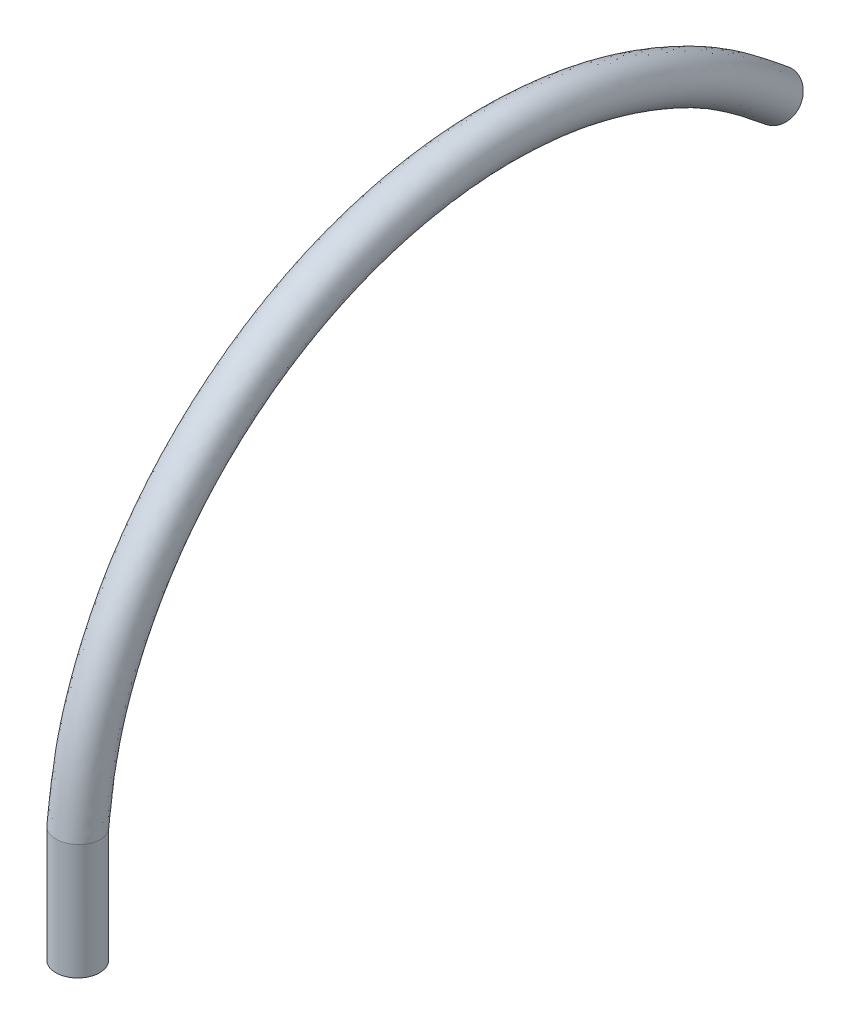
ISO-10303-21;
HEADER;
FILE_DESCRIPTION(('STEP AP214'),'2;1');
FILE_NAME('part.step','',(''),(''),'','','');
FILE_SCHEMA(('AUTOMOTIVE_DESIGN { 1 0 10303 214 1 1 1 1 }'));
ENDSEC;
DATA;
#1=APPLICATION_CONTEXT('core data for automotive mechanical design processes');
#2=APPLICATION_PROTOCOL_DEFINITION('international standard','automotive_design',2000,#1);
#3=PRODUCT_CONTEXT('',#1,'mechanical');
#4=PRODUCT('Part','Part','',(#3));
#5=PRODUCT_RELATED_PRODUCT_CATEGORY('part','',(#4));
#6=PRODUCT_DEFINITION_FORMATION('','',#4);
#7=PRODUCT_DEFINITION_CONTEXT('part definition',#1,'design');
#8=PRODUCT_DEFINITION('design','',#6,#7);
#9=PRODUCT_DEFINITION_SHAPE('','',#8);
#10=(LENGTH_UNIT() NAMED_UNIT(*) SI_UNIT(.MILLI.,.METRE.));
#11=(NAMED_UNIT(*) PLANE_ANGLE_UNIT() SI_UNIT($,.RADIAN.));
#12=(NAMED_UNIT(*) SI_UNIT($,.STERADIAN.) SOLID_ANGLE_UNIT());
#13=UNCERTAINTY_MEASURE_WITH_UNIT(LENGTH_MEASURE(1.E-05),#10,'distance_accuracy_value','');
#14=(GEOMETRIC_REPRESENTATION_CONTEXT(3) GLOBAL_UNCERTAINTY_ASSIGNED_CONTEXT((#13)) GLOBAL_UNIT_ASSIGNED_CONTEXT((#10,
#11,#12)) REPRESENTATION_CONTEXT('',''));
#15=CARTESIAN_POINT('',(0.,0.,0.));
#16=DIRECTION('',(0.,0.,1.));
#17=DIRECTION('',(1.,0.,0.));
#18=AXIS2_PLACEMENT_3D('',#15,#16,#17);
#19=CARTESIAN_POINT('',(0.,25.655313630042,0.));
#20=DIRECTION('',(0.,-1.,0.));
#21=DIRECTION('',(0.,0.,-1.));
#22=AXIS2_PLACEMENT_3D('',#19,#20,#21);
#23=CYLINDRICAL_SURFACE('',#22,3.175);
#24=CARTESIAN_POINT('',(0.,0.,0.));
#25=DIRECTION('',(0.,1.,0.));
#26=DIRECTION('',(0.,0.,1.));
#27=AXIS2_PLACEMENT_3D('',#24,#25,#26);
#28=CIRCLE('',#27,3.175);
#29=CARTESIAN_POINT('',(0.,0.,3.175));
#30=VERTEX_POINT('',#29);
#31=EDGE_CURVE('E43',#30,#30,#28,.T.);
#32=ORIENTED_EDGE('',*,*,#31,.T.);
#33=EDGE_LOOP('',(#32));
#34=FACE_BOUND('',#33,.T.);
#35=CARTESIAN_POINT('',(0.,16.6750575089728,0.));
#36=DIRECTION('',(0.,0.999319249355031,-0.0368922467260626));
#37=DIRECTION('',(0.,-0.0368922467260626,-0.999319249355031));
#38=AXIS2_PLACEMENT_3D('',#35,#36,#37);
#39=ELLIPSE('',#38,3.17716285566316,3.175);
#40=CARTESIAN_POINT('',(0.,16.5578448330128,-3.175));
#41=VERTEX_POINT('',#40);
#42=EDGE_CURVE('E11',#41,#41,#39,.T.);
#43=ORIENTED_EDGE('',*,*,#42,.F.);
#44=EDGE_LOOP('',(#43));
#45=FACE_BOUND('',#44,.T.);
#46=ADVANCED_FACE('F37',(#34,#45),#23,.T.);
#47=CARTESIAN_POINT('',(0.,0.,0.));
#48=DIRECTION('',(0.,1.,0.));
#49=DIRECTION('',(0.,0.,1.));
#50=AXIS2_PLACEMENT_3D('',#47,#48,#49);
#51=PLANE('',#50);
#52=ORIENTED_EDGE('',*,*,#31,.F.);
#53=EDGE_LOOP('',(#52));
#54=FACE_BOUND('',#53,.T.);
#55=ADVANCED_FACE('F58',(#54),#51,.F.);
#56=CARTESIAN_POINT('',(0.,60.2253632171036,-103.45804907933));
#57=DIRECTION('',(0.,0.663306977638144,0.748347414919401));
#58=DIRECTION('',(0.,-0.748347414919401,0.663306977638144));
#59=AXIS2_PLACEMENT_3D('',#56,#57,#58);
#60=PLANE('',#59);
#61=CARTESIAN_POINT('',(0.,57.8493601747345,-101.352049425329));
#62=DIRECTION('',(0.,0.663306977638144,0.748347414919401));
#63=DIRECTION('',(0.,-0.748347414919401,0.663306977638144));
#64=AXIS2_PLACEMENT_3D('',#61,#62,#63);
#65=CIRCLE('',#64,3.175);
#66=CARTESIAN_POINT('',(0.,55.4733571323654,-99.2460497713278));
#67=VERTEX_POINT('',#66);
#68=EDGE_CURVE('E47',#67,#67,#65,.T.);
#69=ORIENTED_EDGE('',*,*,#68,.F.);
#70=EDGE_LOOP('',(#69));
#71=FACE_BOUND('',#70,.T.);
#72=ADVANCED_FACE('F56',(#71),#60,.F.);
#73=CARTESIAN_POINT('',(0.,16.5578448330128,-3.175));
#74=CARTESIAN_POINT('',(0.,19.6569545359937,-3.55754417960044));
#75=CARTESIAN_POINT('',(0.,26.1233456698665,-4.35573479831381));
#76=CARTESIAN_POINT('',(0.,35.7163699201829,-7.68992470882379));
#77=CARTESIAN_POINT('',(0.,45.1530595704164,-12.8836936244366));
#78=CARTESIAN_POINT('',(0.,53.7581256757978,-20.0995963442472));
#79=CARTESIAN_POINT('',(0.,60.8878733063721,-28.9676408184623));
#80=CARTESIAN_POINT('',(0.,66.1439355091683,-39.0058140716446));
#81=CARTESIAN_POINT('',(0.,69.3561023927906,-49.8765784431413));
#82=CARTESIAN_POINT('',(0.,70.4061197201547,-61.2116300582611));
#83=CARTESIAN_POINT('',(0.,69.2471090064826,-72.3811682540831));
#84=CARTESIAN_POINT('',(0.,66.0856498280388,-82.674389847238));
#85=CARTESIAN_POINT('',(0.,61.5191505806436,-91.7417477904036));
#86=CARTESIAN_POINT('',(0.,57.4321439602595,-96.8147183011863));
#87=CARTESIAN_POINT('',(0.,55.4733571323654,-99.2460497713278));
#88=CARTESIAN_POINT('',(-6.35,16.5578448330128,-3.175));
#89=CARTESIAN_POINT('',(-6.35,19.6569545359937,-3.55754417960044));
#90=CARTESIAN_POINT('',(-6.35,26.1233456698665,-4.35573479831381));
#91=CARTESIAN_POINT('',(-6.35,35.7163699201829,-7.68992470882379));
#92=CARTESIAN_POINT('',(-6.35,45.1530595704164,-12.8836936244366));
#93=CARTESIAN_POINT('',(-6.35,53.7581256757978,-20.0995963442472));
#94=CARTESIAN_POINT('',(-6.35,60.8878733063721,-28.9676408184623));
#95=CARTESIAN_POINT('',(-6.35,66.1439355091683,-39.0058140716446));
#96=CARTESIAN_POINT('',(-6.35,69.3561023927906,-49.8765784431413));
#97=CARTESIAN_POINT('',(-6.35,70.4061197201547,-61.211630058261));
#98=CARTESIAN_POINT('',(-6.35,69.2471090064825,-72.3811682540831));
#99=CARTESIAN_POINT('',(-6.35,66.0856498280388,-82.674389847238));
#100=CARTESIAN_POINT('',(-6.35,61.5191505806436,-91.7417477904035));
#101=CARTESIAN_POINT('',(-6.35,57.4321439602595,-96.8147183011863));
#102=CARTESIAN_POINT('',(-6.35,55.4733571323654,-99.2460497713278));
#103=CARTESIAN_POINT('',(-6.35,16.7922701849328,3.175));
#104=CARTESIAN_POINT('',(-6.35,20.0147579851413,2.80027842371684));
#105=CARTESIAN_POINT('',(-6.35,26.7385814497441,2.01840991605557));
#106=CARTESIAN_POINT('',(-6.35,36.8944721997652,-1.28195103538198));
#107=CARTESIAN_POINT('',(-6.35,47.1486397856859,-6.56066383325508));
#108=CARTESIAN_POINT('',(-6.35,56.9233700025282,-14.2231246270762));
#109=CARTESIAN_POINT('',(-6.35,65.5255461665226,-24.286314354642));
#110=CARTESIAN_POINT('',(-6.35,72.1081812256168,-36.4573307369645));
#111=CARTESIAN_POINT('',(-6.35,75.8997732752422,-49.7588969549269));
#112=CARTESIAN_POINT('',(-6.35,76.7777547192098,-62.9622461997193));
#113=CARTESIAN_POINT('',(-6.35,75.1406281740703,-75.274180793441));
#114=CARTESIAN_POINT('',(-6.35,71.4934514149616,-86.2193046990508));
#115=CARTESIAN_POINT('',(-6.35,66.5330491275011,-95.6799480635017));
#116=CARTESIAN_POINT('',(-6.35,62.2690010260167,-100.938008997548));
#117=CARTESIAN_POINT('',(-6.35,60.2253632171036,-103.45804907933));
#118=CARTESIAN_POINT('',(0.,16.7922701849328,3.175));
#119=CARTESIAN_POINT('',(0.,20.0147579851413,2.80027842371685));
#120=CARTESIAN_POINT('',(0.,26.7385814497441,2.01840991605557));
#121=CARTESIAN_POINT('',(0.,36.8944721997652,-1.28195103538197));
#122=CARTESIAN_POINT('',(0.,47.1486397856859,-6.56066383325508));
#123=CARTESIAN_POINT('',(0.,56.9233700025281,-14.2231246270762));
#124=CARTESIAN_POINT('',(0.,65.5255461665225,-24.286314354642));
#125=CARTESIAN_POINT('',(0.,72.1081812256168,-36.4573307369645));
#126=CARTESIAN_POINT('',(0.,75.8997732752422,-49.7588969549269));
#127=CARTESIAN_POINT('',(0.,76.7777547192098,-62.9622461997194));
#128=CARTESIAN_POINT('',(0.,75.1406281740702,-75.274180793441));
#129=CARTESIAN_POINT('',(0.,71.4934514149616,-86.2193046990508));
#130=CARTESIAN_POINT('',(0.,66.5330491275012,-95.6799480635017));
#131=CARTESIAN_POINT('',(0.,62.2690010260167,-100.938008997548));
#132=CARTESIAN_POINT('',(0.,60.2253632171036,-103.45804907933));
#133=CARTESIAN_POINT('',(6.35,16.7922701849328,3.175));
#134=CARTESIAN_POINT('',(6.35,20.0147579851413,2.80027842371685));
#135=CARTESIAN_POINT('',(6.35,26.7385814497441,2.01840991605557));
#136=CARTESIAN_POINT('',(6.35,36.8944721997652,-1.28195103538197));
#137=CARTESIAN_POINT('',(6.35,47.1486397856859,-6.56066383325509));
#138=CARTESIAN_POINT('',(6.35,56.9233700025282,-14.2231246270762));
#139=CARTESIAN_POINT('',(6.35,65.5255461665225,-24.286314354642));
#140=CARTESIAN_POINT('',(6.35,72.1081812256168,-36.4573307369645));
#141=CARTESIAN_POINT('',(6.35,75.8997732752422,-49.758896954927));
#142=CARTESIAN_POINT('',(6.35,76.7777547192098,-62.9622461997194));
#143=CARTESIAN_POINT('',(6.35,75.1406281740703,-75.2741807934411));
#144=CARTESIAN_POINT('',(6.35,71.4934514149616,-86.2193046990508));
#145=CARTESIAN_POINT('',(6.35,66.5330491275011,-95.6799480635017));
#146=CARTESIAN_POINT('',(6.35,62.2690010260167,-100.938008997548));
#147=CARTESIAN_POINT('',(6.35,60.2253632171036,-103.45804907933));
#148=CARTESIAN_POINT('',(6.35,16.5578448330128,-3.175));
#149=CARTESIAN_POINT('',(6.35,19.6569545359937,-3.55754417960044));
#150=CARTESIAN_POINT('',(6.35,26.1233456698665,-4.35573479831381));
#151=CARTESIAN_POINT('',(6.35,35.7163699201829,-7.68992470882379));
#152=CARTESIAN_POINT('',(6.35,45.1530595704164,-12.8836936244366));
#153=CARTESIAN_POINT('',(6.35,53.7581256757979,-20.0995963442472));
#154=CARTESIAN_POINT('',(6.35,60.8878733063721,-28.9676408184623));
#155=CARTESIAN_POINT('',(6.35,66.1439355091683,-39.0058140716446));
#156=CARTESIAN_POINT('',(6.35,69.3561023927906,-49.8765784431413));
#157=CARTESIAN_POINT('',(6.35,70.4061197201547,-61.2116300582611));
#158=CARTESIAN_POINT('',(6.35,69.2471090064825,-72.3811682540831));
#159=CARTESIAN_POINT('',(6.35,66.0856498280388,-82.6743898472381));
#160=CARTESIAN_POINT('',(6.35,61.5191505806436,-91.7417477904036));
#161=CARTESIAN_POINT('',(6.35,57.4321439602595,-96.8147183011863));
#162=CARTESIAN_POINT('',(6.35,55.4733571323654,-99.2460497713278));
#163=CARTESIAN_POINT('',(0.,16.5578448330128,-3.175));
#164=CARTESIAN_POINT('',(0.,19.6569545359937,-3.55754417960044));
#165=CARTESIAN_POINT('',(0.,26.1233456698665,-4.35573479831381));
#166=CARTESIAN_POINT('',(0.,35.7163699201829,-7.68992470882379));
#167=CARTESIAN_POINT('',(0.,45.1530595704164,-12.8836936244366));
#168=CARTESIAN_POINT('',(0.,53.7581256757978,-20.0995963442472));
#169=CARTESIAN_POINT('',(0.,60.8878733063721,-28.9676408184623));
#170=CARTESIAN_POINT('',(0.,66.1439355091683,-39.0058140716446));
#171=CARTESIAN_POINT('',(0.,69.3561023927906,-49.8765784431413));
#172=CARTESIAN_POINT('',(0.,70.4061197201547,-61.2116300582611));
#173=CARTESIAN_POINT('',(0.,69.2471090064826,-72.3811682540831));
#174=CARTESIAN_POINT('',(0.,66.0856498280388,-82.674389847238));
#175=CARTESIAN_POINT('',(0.,61.5191505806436,-91.7417477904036));
#176=CARTESIAN_POINT('',(0.,57.4321439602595,-96.8147183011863));
#177=CARTESIAN_POINT('',(0.,55.4733571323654,-99.2460497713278));
#178=(BOUNDED_SURFACE() B_SPLINE_SURFACE(3,3,((#73,#74,#75,#76,#77,#78,#79,#80,#81,#82,#83,#84,
#85,#86,#87),(#88,#89,#90,#91,#92,#93,#94,#95,#96,#97,#98,#99,#100,#101,#102),(#103,#104,#105,
#106,#107,#108,#109,#110,#111,#112,#113,#114,#115,#116,#117),(#118,#119,#120,#121,#122,#123,
#124,#125,#126,#127,#128,#129,#130,#131,#132),(#133,#134,#135,#136,#137,#138,#139,#140,#141,
#142,#143,#144,#145,#146,#147),(#148,#149,#150,#151,#152,#153,#154,#155,#156,#157,#158,#159,
#160,#161,#162),(#163,#164,#165,#166,#167,#168,#169,#170,#171,#172,#173,#174,#175,#176,#177)),
.UNSPECIFIED.,.T.,.F.,.F.) B_SPLINE_SURFACE_WITH_KNOTS((4,3,4),(4,1,1,1,1,1,1,1,1,1,1,1,4),(0.,
0.5,1.),(0.,0.0707129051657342,0.147544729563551,0.23003260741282,0.317280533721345,
0.407816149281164,0.500004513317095,0.59219567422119,0.682733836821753,0.769979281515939,
0.852461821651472,0.929289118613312,1.),
.UNSPECIFIED.) GEOMETRIC_REPRESENTATION_ITEM() RATIONAL_B_SPLINE_SURFACE(((1.,1.,1.,1.,1.,1.,1.,
1.,1.,1.,1.,1.,1.,1.,1.),(0.333333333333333,0.333333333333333,0.333333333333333,
0.333333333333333,0.333333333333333,0.333333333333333,0.333333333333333,0.333333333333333,
0.333333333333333,0.333333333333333,0.333333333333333,0.333333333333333,0.333333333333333,
0.333333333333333,0.333333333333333),(0.333333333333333,0.333333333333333,0.333333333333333,
0.333333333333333,0.333333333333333,0.333333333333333,0.333333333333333,0.333333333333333,
0.333333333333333,0.333333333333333,0.333333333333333,0.333333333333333,0.333333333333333,
0.333333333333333,0.333333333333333),(1.,1.,1.,1.,1.,1.,1.,1.,1.,1.,1.,1.,1.,1.,1.),
(0.333333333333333,0.333333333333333,0.333333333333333,0.333333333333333,0.333333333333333,
0.333333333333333,0.333333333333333,0.333333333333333,0.333333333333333,0.333333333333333,
0.333333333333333,0.333333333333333,0.333333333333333,0.333333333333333,0.333333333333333),
(0.333333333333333,0.333333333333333,0.333333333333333,0.333333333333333,0.333333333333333,
0.333333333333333,0.333333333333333,0.333333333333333,0.333333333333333,0.333333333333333,
0.333333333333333,0.333333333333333,0.333333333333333,0.333333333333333,0.333333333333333),(1.,
1.,1.,1.,1.,1.,1.,1.,1.,1.,1.,1.,1.,1.,1.))) REPRESENTATION_ITEM('') SURFACE());
#179=ORIENTED_EDGE('',*,*,#42,.T.);
#180=EDGE_LOOP('',(#179));
#181=FACE_BOUND('',#180,.T.);
#182=ORIENTED_EDGE('',*,*,#68,.T.);
#183=EDGE_LOOP('',(#182));
#184=FACE_BOUND('',#183,.T.);
#185=ADVANCED_FACE('F54',(#181,#184),#178,.T.);
#186=CLOSED_SHELL('',(#46,#55,#72,#185));
#187=MANIFOLD_SOLID_BREP('B2',#186);
#188=ADVANCED_BREP_SHAPE_REPRESENTATION('',(#18,#187),#14);
#189=SHAPE_DEFINITION_REPRESENTATION(#9,#188);
ENDSEC;
END-ISO-10303-21;
